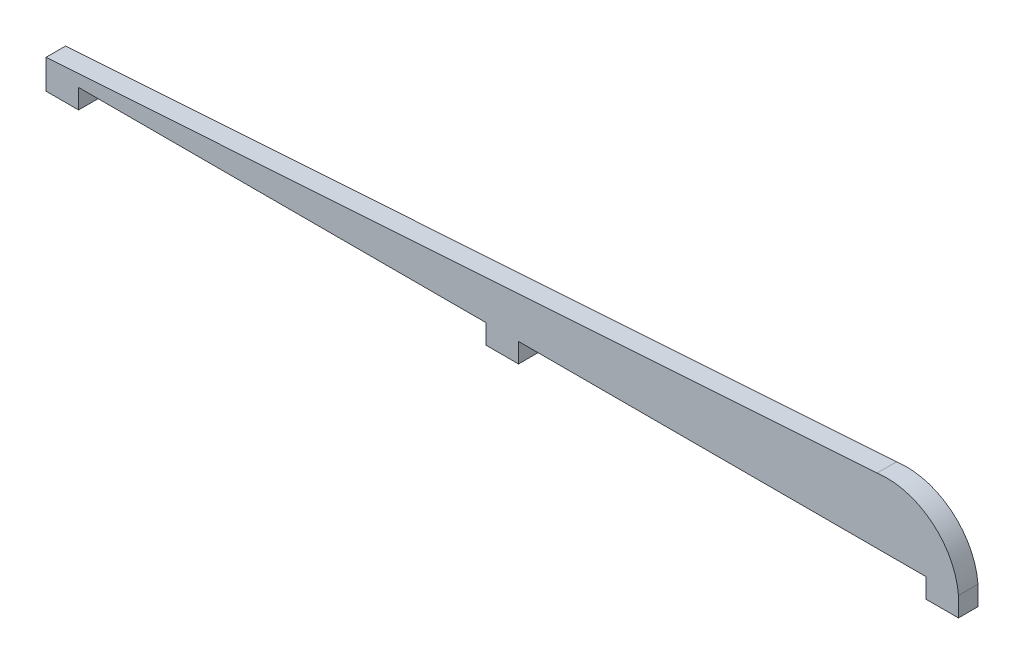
ISO-10303-21;
HEADER;
FILE_DESCRIPTION(('STEP AP214'),'2;1');
FILE_NAME('part.step','',(''),(''),'','','');
FILE_SCHEMA(('AUTOMOTIVE_DESIGN { 1 0 10303 214 1 1 1 1 }'));
ENDSEC;
DATA;
#1=APPLICATION_CONTEXT('core data for automotive mechanical design processes');
#2=APPLICATION_PROTOCOL_DEFINITION('international standard','automotive_design',2000,#1);
#3=PRODUCT_CONTEXT('',#1,'mechanical');
#4=PRODUCT('Part','Part','',(#3));
#5=PRODUCT_RELATED_PRODUCT_CATEGORY('part','',(#4));
#6=PRODUCT_DEFINITION_FORMATION('','',#4);
#7=PRODUCT_DEFINITION_CONTEXT('part definition',#1,'design');
#8=PRODUCT_DEFINITION('design','',#6,#7);
#9=PRODUCT_DEFINITION_SHAPE('','',#8);
#10=(LENGTH_UNIT() NAMED_UNIT(*) SI_UNIT(.MILLI.,.METRE.));
#11=(NAMED_UNIT(*) PLANE_ANGLE_UNIT() SI_UNIT($,.RADIAN.));
#12=(NAMED_UNIT(*) SI_UNIT($,.STERADIAN.) SOLID_ANGLE_UNIT());
#13=UNCERTAINTY_MEASURE_WITH_UNIT(LENGTH_MEASURE(1.E-05),#10,'distance_accuracy_value','');
#14=(GEOMETRIC_REPRESENTATION_CONTEXT(3) GLOBAL_UNCERTAINTY_ASSIGNED_CONTEXT((#13)) GLOBAL_UNIT_ASSIGNED_CONTEXT((#10,
#11,#12)) REPRESENTATION_CONTEXT('',''));
#15=CARTESIAN_POINT('',(0.,0.,0.));
#16=DIRECTION('',(0.,0.,1.));
#17=DIRECTION('',(1.,0.,0.));
#18=AXIS2_PLACEMENT_3D('',#15,#16,#17);
#19=CARTESIAN_POINT('',(-139.999999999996,-6.,6.));
#20=DIRECTION('',(0.,1.,0.));
#21=DIRECTION('',(-1.,0.,0.));
#22=AXIS2_PLACEMENT_3D('',#19,#20,#21);
#23=PLANE('',#22);
#24=DIRECTION('',(1.,0.,0.));
#25=VECTOR('',#24,1.);
#26=CARTESIAN_POINT('',(-139.999999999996,-6.,0.));
#27=LINE('',#26,#25);
#28=CARTESIAN_POINT('',(-139.999999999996,-6.,0.));
#29=VERTEX_POINT('',#28);
#30=CARTESIAN_POINT('',(-129.999999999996,-6.,0.));
#31=VERTEX_POINT('',#30);
#32=EDGE_CURVE('E162',#29,#31,#27,.T.);
#33=ORIENTED_EDGE('',*,*,#32,.T.);
#34=DIRECTION('',(0.,0.,-1.));
#35=VECTOR('',#34,1.);
#36=CARTESIAN_POINT('',(-129.999999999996,-6.,6.));
#37=LINE('',#36,#35);
#38=CARTESIAN_POINT('',(-129.999999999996,-6.,6.));
#39=VERTEX_POINT('',#38);
#40=EDGE_CURVE('E40',#39,#31,#37,.T.);
#41=ORIENTED_EDGE('',*,*,#40,.F.);
#42=DIRECTION('',(1.,0.,0.));
#43=VECTOR('',#42,1.);
#44=CARTESIAN_POINT('',(-139.999999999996,-6.,6.));
#45=LINE('',#44,#43);
#46=CARTESIAN_POINT('',(-139.999999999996,-6.,6.));
#47=VERTEX_POINT('',#46);
#48=EDGE_CURVE('E107',#47,#39,#45,.T.);
#49=ORIENTED_EDGE('',*,*,#48,.F.);
#50=DIRECTION('',(0.,0.,-1.));
#51=VECTOR('',#50,1.);
#52=CARTESIAN_POINT('',(-139.999999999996,-6.,6.));
#53=LINE('',#52,#51);
#54=EDGE_CURVE('E11',#47,#29,#53,.T.);
#55=ORIENTED_EDGE('',*,*,#54,.T.);
#56=EDGE_LOOP('',(#33,#41,#49,#55));
#57=FACE_BOUND('',#56,.T.);
#58=ADVANCED_FACE('F32',(#57),#23,.F.);
#59=CARTESIAN_POINT('',(-129.999999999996,0.,6.));
#60=DIRECTION('',(-1.,0.,0.));
#61=DIRECTION('',(0.,0.,1.));
#62=AXIS2_PLACEMENT_3D('',#59,#60,#61);
#63=PLANE('',#62);
#64=DIRECTION('',(0.,1.,0.));
#65=VECTOR('',#64,1.);
#66=CARTESIAN_POINT('',(-129.999999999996,0.,0.));
#67=LINE('',#66,#65);
#68=CARTESIAN_POINT('',(-129.999999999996,0.,0.));
#69=VERTEX_POINT('',#68);
#70=EDGE_CURVE('E164',#31,#69,#67,.T.);
#71=ORIENTED_EDGE('',*,*,#70,.T.);
#72=DIRECTION('',(0.,0.,-1.));
#73=VECTOR('',#72,1.);
#74=CARTESIAN_POINT('',(-129.999999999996,0.,6.));
#75=LINE('',#74,#73);
#76=CARTESIAN_POINT('',(-129.999999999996,0.,6.));
#77=VERTEX_POINT('',#76);
#78=EDGE_CURVE('E206',#77,#69,#75,.T.);
#79=ORIENTED_EDGE('',*,*,#78,.F.);
#80=DIRECTION('',(0.,1.,0.));
#81=VECTOR('',#80,1.);
#82=CARTESIAN_POINT('',(-129.999999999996,0.,6.));
#83=LINE('',#82,#81);
#84=EDGE_CURVE('E214',#39,#77,#83,.T.);
#85=ORIENTED_EDGE('',*,*,#84,.F.);
#86=ORIENTED_EDGE('',*,*,#40,.T.);
#87=EDGE_LOOP('',(#71,#79,#85,#86));
#88=FACE_BOUND('',#87,.T.);
#89=ADVANCED_FACE('F212',(#88),#63,.F.);
#90=CARTESIAN_POINT('',(-129.999999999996,0.,6.));
#91=DIRECTION('',(0.,1.,0.));
#92=DIRECTION('',(0.,0.,1.));
#93=AXIS2_PLACEMENT_3D('',#90,#91,#92);
#94=PLANE('',#93);
#95=DIRECTION('',(1.,0.,0.));
#96=VECTOR('',#95,1.);
#97=CARTESIAN_POINT('',(-129.999999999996,0.,0.));
#98=LINE('',#97,#96);
#99=CARTESIAN_POINT('',(-4.99999999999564,0.,0.));
#100=VERTEX_POINT('',#99);
#101=EDGE_CURVE('E166',#69,#100,#98,.T.);
#102=ORIENTED_EDGE('',*,*,#101,.T.);
#103=DIRECTION('',(0.,0.,-1.));
#104=VECTOR('',#103,1.);
#105=CARTESIAN_POINT('',(-4.99999999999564,0.,6.));
#106=LINE('',#105,#104);
#107=CARTESIAN_POINT('',(-4.99999999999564,0.,6.));
#108=VERTEX_POINT('',#107);
#109=EDGE_CURVE('E203',#108,#100,#106,.T.);
#110=ORIENTED_EDGE('',*,*,#109,.F.);
#111=DIRECTION('',(1.,0.,0.));
#112=VECTOR('',#111,1.);
#113=CARTESIAN_POINT('',(-129.999999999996,0.,6.));
#114=LINE('',#113,#112);
#115=EDGE_CURVE('E233',#77,#108,#114,.T.);
#116=ORIENTED_EDGE('',*,*,#115,.F.);
#117=ORIENTED_EDGE('',*,*,#78,.T.);
#118=EDGE_LOOP('',(#102,#110,#116,#117));
#119=FACE_BOUND('',#118,.T.);
#120=ADVANCED_FACE('F224',(#119),#94,.F.);
#121=CARTESIAN_POINT('',(-4.99999999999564,0.,6.));
#122=DIRECTION('',(1.,0.,0.));
#123=DIRECTION('',(0.,1.,0.));
#124=AXIS2_PLACEMENT_3D('',#121,#122,#123);
#125=PLANE('',#124);
#126=DIRECTION('',(0.,-1.,0.));
#127=VECTOR('',#126,1.);
#128=CARTESIAN_POINT('',(-4.99999999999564,0.,0.));
#129=LINE('',#128,#127);
#130=CARTESIAN_POINT('',(-4.99999999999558,-6.,0.));
#131=VERTEX_POINT('',#130);
#132=EDGE_CURVE('E168',#100,#131,#129,.T.);
#133=ORIENTED_EDGE('',*,*,#132,.T.);
#134=DIRECTION('',(0.,0.,-1.));
#135=VECTOR('',#134,1.);
#136=CARTESIAN_POINT('',(-4.99999999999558,-6.,6.));
#137=LINE('',#136,#135);
#138=CARTESIAN_POINT('',(-4.99999999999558,-6.,6.));
#139=VERTEX_POINT('',#138);
#140=EDGE_CURVE('E200',#139,#131,#137,.T.);
#141=ORIENTED_EDGE('',*,*,#140,.F.);
#142=DIRECTION('',(0.,-1.,0.));
#143=VECTOR('',#142,1.);
#144=CARTESIAN_POINT('',(-4.99999999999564,0.,6.));
#145=LINE('',#144,#143);
#146=EDGE_CURVE('E230',#108,#139,#145,.T.);
#147=ORIENTED_EDGE('',*,*,#146,.F.);
#148=ORIENTED_EDGE('',*,*,#109,.T.);
#149=EDGE_LOOP('',(#133,#141,#147,#148));
#150=FACE_BOUND('',#149,.T.);
#151=ADVANCED_FACE('F228',(#150),#125,.F.);
#152=CARTESIAN_POINT('',(-4.99999999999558,-6.,6.));
#153=DIRECTION('',(0.,1.,0.));
#154=DIRECTION('',(-1.,0.,0.));
#155=AXIS2_PLACEMENT_3D('',#152,#153,#154);
#156=PLANE('',#155);
#157=DIRECTION('',(1.,0.,0.));
#158=VECTOR('',#157,1.);
#159=CARTESIAN_POINT('',(-4.99999999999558,-6.,0.));
#160=LINE('',#159,#158);
#161=CARTESIAN_POINT('',(5.00000000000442,-6.,0.));
#162=VERTEX_POINT('',#161);
#163=EDGE_CURVE('E170',#131,#162,#160,.T.);
#164=ORIENTED_EDGE('',*,*,#163,.T.);
#165=DIRECTION('',(0.,0.,-1.));
#166=VECTOR('',#165,1.);
#167=CARTESIAN_POINT('',(5.00000000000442,-6.,6.));
#168=LINE('',#167,#166);
#169=CARTESIAN_POINT('',(5.00000000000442,-6.,6.));
#170=VERTEX_POINT('',#169);
#171=EDGE_CURVE('E197',#170,#162,#168,.T.);
#172=ORIENTED_EDGE('',*,*,#171,.F.);
#173=DIRECTION('',(1.,0.,0.));
#174=VECTOR('',#173,1.);
#175=CARTESIAN_POINT('',(-4.99999999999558,-6.,6.));
#176=LINE('',#175,#174);
#177=EDGE_CURVE('E232',#139,#170,#176,.T.);
#178=ORIENTED_EDGE('',*,*,#177,.F.);
#179=ORIENTED_EDGE('',*,*,#140,.T.);
#180=EDGE_LOOP('',(#164,#172,#178,#179));
#181=FACE_BOUND('',#180,.T.);
#182=ADVANCED_FACE('F277',(#181),#156,.F.);
#183=CARTESIAN_POINT('',(5.00000000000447,0.,6.));
#184=DIRECTION('',(-1.,0.,0.));
#185=DIRECTION('',(0.,-1.,0.));
#186=AXIS2_PLACEMENT_3D('',#183,#184,#185);
#187=PLANE('',#186);
#188=DIRECTION('',(0.,1.,0.));
#189=VECTOR('',#188,1.);
#190=CARTESIAN_POINT('',(5.00000000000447,0.,0.));
#191=LINE('',#190,#189);
#192=CARTESIAN_POINT('',(5.00000000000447,0.,0.));
#193=VERTEX_POINT('',#192);
#194=EDGE_CURVE('E172',#162,#193,#191,.T.);
#195=ORIENTED_EDGE('',*,*,#194,.T.);
#196=DIRECTION('',(0.,0.,-1.));
#197=VECTOR('',#196,1.);
#198=CARTESIAN_POINT('',(5.00000000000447,0.,6.));
#199=LINE('',#198,#197);
#200=CARTESIAN_POINT('',(5.00000000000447,0.,6.));
#201=VERTEX_POINT('',#200);
#202=EDGE_CURVE('E194',#201,#193,#199,.T.);
#203=ORIENTED_EDGE('',*,*,#202,.F.);
#204=DIRECTION('',(0.,1.,0.));
#205=VECTOR('',#204,1.);
#206=CARTESIAN_POINT('',(5.00000000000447,0.,6.));
#207=LINE('',#206,#205);
#208=EDGE_CURVE('E235',#170,#201,#207,.T.);
#209=ORIENTED_EDGE('',*,*,#208,.F.);
#210=ORIENTED_EDGE('',*,*,#171,.T.);
#211=EDGE_LOOP('',(#195,#203,#209,#210));
#212=FACE_BOUND('',#211,.T.);
#213=ADVANCED_FACE('F280',(#212),#187,.F.);
#214=CARTESIAN_POINT('',(5.00000000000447,0.,6.));
#215=DIRECTION('',(0.,1.,0.));
#216=DIRECTION('',(0.,0.,1.));
#217=AXIS2_PLACEMENT_3D('',#214,#215,#216);
#218=PLANE('',#217);
#219=DIRECTION('',(1.,0.,0.));
#220=VECTOR('',#219,1.);
#221=CARTESIAN_POINT('',(5.00000000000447,0.,0.));
#222=LINE('',#221,#220);
#223=CARTESIAN_POINT('',(130.000000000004,0.,0.));
#224=VERTEX_POINT('',#223);
#225=EDGE_CURVE('E174',#193,#224,#222,.T.);
#226=ORIENTED_EDGE('',*,*,#225,.T.);
#227=DIRECTION('',(0.,0.,-1.));
#228=VECTOR('',#227,1.);
#229=CARTESIAN_POINT('',(130.000000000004,0.,6.));
#230=LINE('',#229,#228);
#231=CARTESIAN_POINT('',(130.000000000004,0.,6.));
#232=VERTEX_POINT('',#231);
#233=EDGE_CURVE('E191',#232,#224,#230,.T.);
#234=ORIENTED_EDGE('',*,*,#233,.F.);
#235=DIRECTION('',(1.,0.,0.));
#236=VECTOR('',#235,1.);
#237=CARTESIAN_POINT('',(5.00000000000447,0.,6.));
#238=LINE('',#237,#236);
#239=EDGE_CURVE('E241',#201,#232,#238,.T.);
#240=ORIENTED_EDGE('',*,*,#239,.F.);
#241=ORIENTED_EDGE('',*,*,#202,.T.);
#242=EDGE_LOOP('',(#226,#234,#240,#241));
#243=FACE_BOUND('',#242,.T.);
#244=ADVANCED_FACE('F284',(#243),#218,.F.);
#245=CARTESIAN_POINT('',(130.000000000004,0.,6.));
#246=DIRECTION('',(1.,0.,0.));
#247=DIRECTION('',(0.,0.,-1.));
#248=AXIS2_PLACEMENT_3D('',#245,#246,#247);
#249=PLANE('',#248);
#250=DIRECTION('',(0.,-1.,0.));
#251=VECTOR('',#250,1.);
#252=CARTESIAN_POINT('',(130.000000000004,0.,0.));
#253=LINE('',#252,#251);
#254=CARTESIAN_POINT('',(130.000000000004,-6.,0.));
#255=VERTEX_POINT('',#254);
#256=EDGE_CURVE('E176',#224,#255,#253,.T.);
#257=ORIENTED_EDGE('',*,*,#256,.T.);
#258=DIRECTION('',(0.,0.,-1.));
#259=VECTOR('',#258,1.);
#260=CARTESIAN_POINT('',(130.000000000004,-6.,6.));
#261=LINE('',#260,#259);
#262=CARTESIAN_POINT('',(130.000000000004,-6.,6.));
#263=VERTEX_POINT('',#262);
#264=EDGE_CURVE('E188',#263,#255,#261,.T.);
#265=ORIENTED_EDGE('',*,*,#264,.F.);
#266=DIRECTION('',(0.,-1.,0.));
#267=VECTOR('',#266,1.);
#268=CARTESIAN_POINT('',(130.000000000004,0.,6.));
#269=LINE('',#268,#267);
#270=EDGE_CURVE('E243',#232,#263,#269,.T.);
#271=ORIENTED_EDGE('',*,*,#270,.F.);
#272=ORIENTED_EDGE('',*,*,#233,.T.);
#273=EDGE_LOOP('',(#257,#265,#271,#272));
#274=FACE_BOUND('',#273,.T.);
#275=ADVANCED_FACE('F249',(#274),#249,.F.);
#276=CARTESIAN_POINT('',(140.000000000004,-6.,6.));
#277=DIRECTION('',(0.,1.,0.));
#278=DIRECTION('',(-1.,0.,0.));
#279=AXIS2_PLACEMENT_3D('',#276,#277,#278);
#280=PLANE('',#279);
#281=DIRECTION('',(1.,0.,0.));
#282=VECTOR('',#281,1.);
#283=CARTESIAN_POINT('',(140.000000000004,-6.,0.));
#284=LINE('',#283,#282);
#285=CARTESIAN_POINT('',(140.000000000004,-6.,0.));
#286=VERTEX_POINT('',#285);
#287=EDGE_CURVE('E178',#255,#286,#284,.T.);
#288=ORIENTED_EDGE('',*,*,#287,.T.);
#289=DIRECTION('',(0.,0.,-1.));
#290=VECTOR('',#289,1.);
#291=CARTESIAN_POINT('',(140.000000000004,-6.,6.));
#292=LINE('',#291,#290);
#293=CARTESIAN_POINT('',(140.000000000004,-6.,6.));
#294=VERTEX_POINT('',#293);
#295=EDGE_CURVE('E151',#294,#286,#292,.T.);
#296=ORIENTED_EDGE('',*,*,#295,.F.);
#297=DIRECTION('',(1.,0.,0.));
#298=VECTOR('',#297,1.);
#299=CARTESIAN_POINT('',(140.000000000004,-6.,6.));
#300=LINE('',#299,#298);
#301=EDGE_CURVE('E142',#263,#294,#300,.T.);
#302=ORIENTED_EDGE('',*,*,#301,.F.);
#303=ORIENTED_EDGE('',*,*,#264,.T.);
#304=EDGE_LOOP('',(#288,#296,#302,#303));
#305=FACE_BOUND('',#304,.T.);
#306=ADVANCED_FACE('F253',(#305),#280,.F.);
#307=CARTESIAN_POINT('',(140.000000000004,0.,6.));
#308=DIRECTION('',(-1.,0.,0.));
#309=DIRECTION('',(0.,0.,1.));
#310=AXIS2_PLACEMENT_3D('',#307,#308,#309);
#311=PLANE('',#310);
#312=DIRECTION('',(0.,1.,0.));
#313=VECTOR('',#312,1.);
#314=CARTESIAN_POINT('',(140.000000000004,0.,0.));
#315=LINE('',#314,#313);
#316=CARTESIAN_POINT('',(140.000000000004,0.,0.));
#317=VERTEX_POINT('',#316);
#318=EDGE_CURVE('E150',#286,#317,#315,.T.);
#319=ORIENTED_EDGE('',*,*,#318,.T.);
#320=DIRECTION('',(0.,0.,-1.));
#321=VECTOR('',#320,1.);
#322=CARTESIAN_POINT('',(140.000000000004,0.,6.));
#323=LINE('',#322,#321);
#324=CARTESIAN_POINT('',(140.000000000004,0.,6.));
#325=VERTEX_POINT('',#324);
#326=EDGE_CURVE('E147',#325,#317,#323,.T.);
#327=ORIENTED_EDGE('',*,*,#326,.F.);
#328=DIRECTION('',(0.,1.,0.));
#329=VECTOR('',#328,1.);
#330=CARTESIAN_POINT('',(140.000000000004,0.,6.));
#331=LINE('',#330,#329);
#332=EDGE_CURVE('E136',#294,#325,#331,.T.);
#333=ORIENTED_EDGE('',*,*,#332,.F.);
#334=ORIENTED_EDGE('',*,*,#295,.T.);
#335=EDGE_LOOP('',(#319,#327,#333,#334));
#336=FACE_BOUND('',#335,.T.);
#337=ADVANCED_FACE('F148',(#336),#311,.F.);
#338=CARTESIAN_POINT('',(118.087091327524,-1.76613584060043,6.));
#339=DIRECTION('',(0.,0.,-1.));
#340=DIRECTION('',(-1.,0.,0.));
#341=AXIS2_PLACEMENT_3D('',#338,#339,#340);
#342=CYLINDRICAL_SURFACE('',#341,21.9839669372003);
#343=CARTESIAN_POINT('',(118.087091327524,-1.76613584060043,0.));
#344=DIRECTION('',(0.,0.,1.));
#345=DIRECTION('',(1.,0.,0.));
#346=AXIS2_PLACEMENT_3D('',#343,#344,#345);
#347=CIRCLE('',#346,21.9839669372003);
#348=CARTESIAN_POINT('',(115.000000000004,20.,0.));
#349=VERTEX_POINT('',#348);
#350=EDGE_CURVE('E93',#317,#349,#347,.T.);
#351=ORIENTED_EDGE('',*,*,#350,.T.);
#352=DIRECTION('',(0.,0.,-1.));
#353=VECTOR('',#352,1.);
#354=CARTESIAN_POINT('',(115.000000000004,20.,6.));
#355=LINE('',#354,#353);
#356=CARTESIAN_POINT('',(115.000000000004,20.,6.));
#357=VERTEX_POINT('',#356);
#358=EDGE_CURVE('E152',#357,#349,#355,.T.);
#359=ORIENTED_EDGE('',*,*,#358,.F.);
#360=CARTESIAN_POINT('',(118.087091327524,-1.76613584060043,6.));
#361=DIRECTION('',(0.,0.,1.));
#362=DIRECTION('',(1.,0.,0.));
#363=AXIS2_PLACEMENT_3D('',#360,#361,#362);
#364=CIRCLE('',#363,21.9839669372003);
#365=EDGE_CURVE('E140',#325,#357,#364,.T.);
#366=ORIENTED_EDGE('',*,*,#365,.F.);
#367=ORIENTED_EDGE('',*,*,#326,.T.);
#368=EDGE_LOOP('',(#351,#359,#366,#367));
#369=FACE_BOUND('',#368,.T.);
#370=ADVANCED_FACE('F154',(#369),#342,.T.);
#371=CARTESIAN_POINT('',(-139.999999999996,3.,6.));
#372=DIRECTION('',(0.0665190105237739,-0.997785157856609,0.));
#373=DIRECTION('',(0.997785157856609,0.0665190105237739,0.));
#374=AXIS2_PLACEMENT_3D('',#371,#372,#373);
#375=PLANE('',#374);
#376=DIRECTION('',(-0.997785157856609,-0.0665190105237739,0.));
#377=VECTOR('',#376,1.);
#378=CARTESIAN_POINT('',(-139.999999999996,3.,0.));
#379=LINE('',#378,#377);
#380=CARTESIAN_POINT('',(-139.999999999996,3.,0.));
#381=VERTEX_POINT('',#380);
#382=EDGE_CURVE('E100',#349,#381,#379,.T.);
#383=ORIENTED_EDGE('',*,*,#382,.T.);
#384=DIRECTION('',(0.,0.,-1.));
#385=VECTOR('',#384,1.);
#386=CARTESIAN_POINT('',(-139.999999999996,3.,6.));
#387=LINE('',#386,#385);
#388=CARTESIAN_POINT('',(-139.999999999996,3.,6.));
#389=VERTEX_POINT('',#388);
#390=EDGE_CURVE('E158',#389,#381,#387,.T.);
#391=ORIENTED_EDGE('',*,*,#390,.F.);
#392=DIRECTION('',(-0.997785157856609,-0.0665190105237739,0.));
#393=VECTOR('',#392,1.);
#394=CARTESIAN_POINT('',(-139.999999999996,3.,6.));
#395=LINE('',#394,#393);
#396=EDGE_CURVE('E156',#357,#389,#395,.T.);
#397=ORIENTED_EDGE('',*,*,#396,.F.);
#398=ORIENTED_EDGE('',*,*,#358,.T.);
#399=EDGE_LOOP('',(#383,#391,#397,#398));
#400=FACE_BOUND('',#399,.T.);
#401=ADVANCED_FACE('F255',(#400),#375,.F.);
#402=CARTESIAN_POINT('',(-139.999999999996,0.,6.));
#403=DIRECTION('',(1.,0.,0.));
#404=DIRECTION('',(0.,0.,-1.));
#405=AXIS2_PLACEMENT_3D('',#402,#403,#404);
#406=PLANE('',#405);
#407=DIRECTION('',(0.,-1.,0.));
#408=VECTOR('',#407,1.);
#409=CARTESIAN_POINT('',(-139.999999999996,0.,0.));
#410=LINE('',#409,#408);
#411=EDGE_CURVE('E183',#381,#29,#410,.T.);
#412=ORIENTED_EDGE('',*,*,#411,.T.);
#413=ORIENTED_EDGE('',*,*,#54,.F.);
#414=DIRECTION('',(0.,-1.,0.));
#415=VECTOR('',#414,1.);
#416=CARTESIAN_POINT('',(-139.999999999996,0.,6.));
#417=LINE('',#416,#415);
#418=EDGE_CURVE('E48',#389,#47,#417,.T.);
#419=ORIENTED_EDGE('',*,*,#418,.F.);
#420=ORIENTED_EDGE('',*,*,#390,.T.);
#421=EDGE_LOOP('',(#412,#413,#419,#420));
#422=FACE_BOUND('',#421,.T.);
#423=ADVANCED_FACE('F254',(#422),#406,.F.);
#424=CARTESIAN_POINT('',(118.087091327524,-1.76613584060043,6.));
#425=DIRECTION('',(0.,0.,1.));
#426=DIRECTION('',(1.,0.,0.));
#427=AXIS2_PLACEMENT_3D('',#424,#425,#426);
#428=PLANE('',#427);
#429=ORIENTED_EDGE('',*,*,#418,.T.);
#430=ORIENTED_EDGE('',*,*,#48,.T.);
#431=ORIENTED_EDGE('',*,*,#84,.T.);
#432=ORIENTED_EDGE('',*,*,#115,.T.);
#433=ORIENTED_EDGE('',*,*,#146,.T.);
#434=ORIENTED_EDGE('',*,*,#177,.T.);
#435=ORIENTED_EDGE('',*,*,#208,.T.);
#436=ORIENTED_EDGE('',*,*,#239,.T.);
#437=ORIENTED_EDGE('',*,*,#270,.T.);
#438=ORIENTED_EDGE('',*,*,#301,.T.);
#439=ORIENTED_EDGE('',*,*,#332,.T.);
#440=ORIENTED_EDGE('',*,*,#365,.T.);
#441=ORIENTED_EDGE('',*,*,#396,.T.);
#442=EDGE_LOOP('',(#429,#430,#431,#432,#433,#434,#435,#436,#437,#438,#439,#440,#441));
#443=FACE_BOUND('',#442,.T.);
#444=ADVANCED_FACE('F138',(#443),#428,.T.);
#445=CARTESIAN_POINT('',(118.087091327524,-1.76613584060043,0.));
#446=DIRECTION('',(0.,0.,1.));
#447=DIRECTION('',(1.,0.,0.));
#448=AXIS2_PLACEMENT_3D('',#445,#446,#447);
#449=PLANE('',#448);
#450=ORIENTED_EDGE('',*,*,#32,.F.);
#451=ORIENTED_EDGE('',*,*,#411,.F.);
#452=ORIENTED_EDGE('',*,*,#382,.F.);
#453=ORIENTED_EDGE('',*,*,#350,.F.);
#454=ORIENTED_EDGE('',*,*,#318,.F.);
#455=ORIENTED_EDGE('',*,*,#287,.F.);
#456=ORIENTED_EDGE('',*,*,#256,.F.);
#457=ORIENTED_EDGE('',*,*,#225,.F.);
#458=ORIENTED_EDGE('',*,*,#194,.F.);
#459=ORIENTED_EDGE('',*,*,#163,.F.);
#460=ORIENTED_EDGE('',*,*,#132,.F.);
#461=ORIENTED_EDGE('',*,*,#101,.F.);
#462=ORIENTED_EDGE('',*,*,#70,.F.);
#463=EDGE_LOOP('',(#450,#451,#452,#453,#454,#455,#456,#457,#458,#459,#460,#461,#462));
#464=FACE_BOUND('',#463,.T.);
#465=ADVANCED_FACE('F218',(#464),#449,.F.);
#466=CLOSED_SHELL('',(#58,#89,#120,#151,#182,#213,#244,#275,#306,#337,#370,#401,#423,#444,#465));
#467=MANIFOLD_SOLID_BREP('B2',#466);
#468=ADVANCED_BREP_SHAPE_REPRESENTATION('',(#18,#467),#14);
#469=SHAPE_DEFINITION_REPRESENTATION(#9,#468);
ENDSEC;
END-ISO-10303-21;
